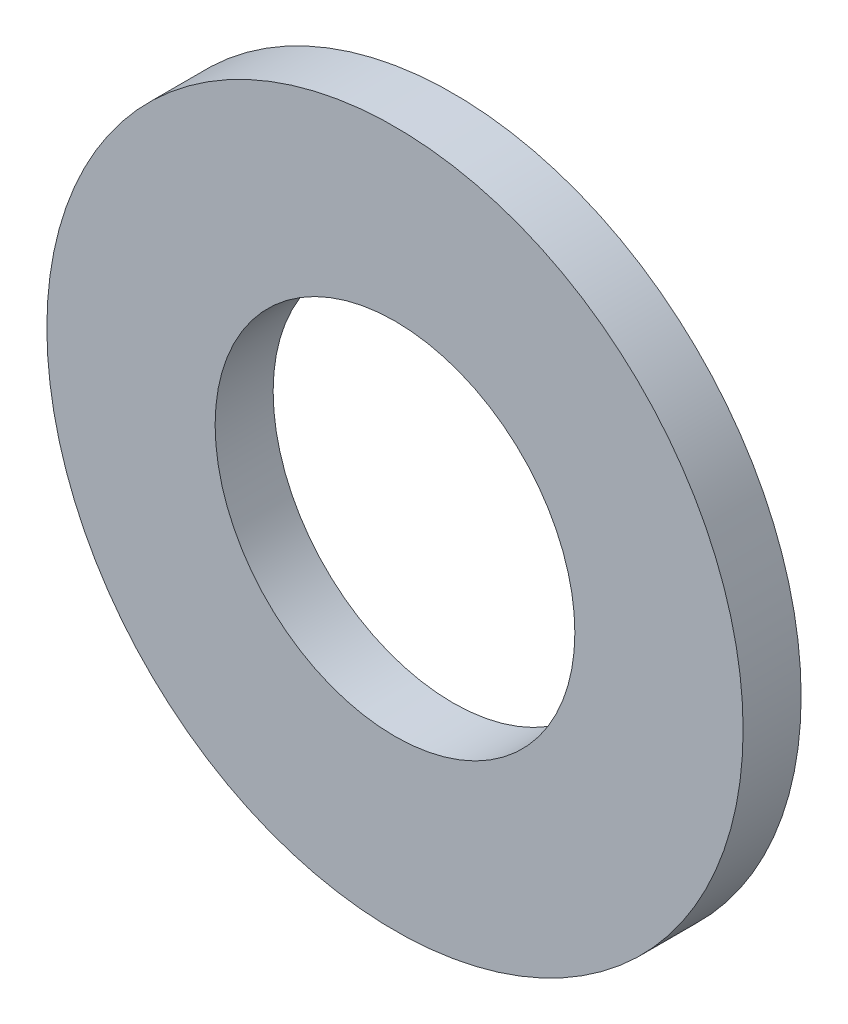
from build123d import *

# Parameters (mm, degrees)
SKETCH1_R      = 9.525
SKETCH1_R_2    = 4.92125
EXTRUDE1_DEPTH = 1.5875


with BuildPart() as part:
    # Sketch1 → Extrude1 (new body)
    with BuildSketch(Plane.XY):
        Circle(SKETCH1_R)
        Circle(SKETCH1_R_2, mode=Mode.SUBTRACT)
    extrude(amount=EXTRUDE1_DEPTH)


solid = part.part
